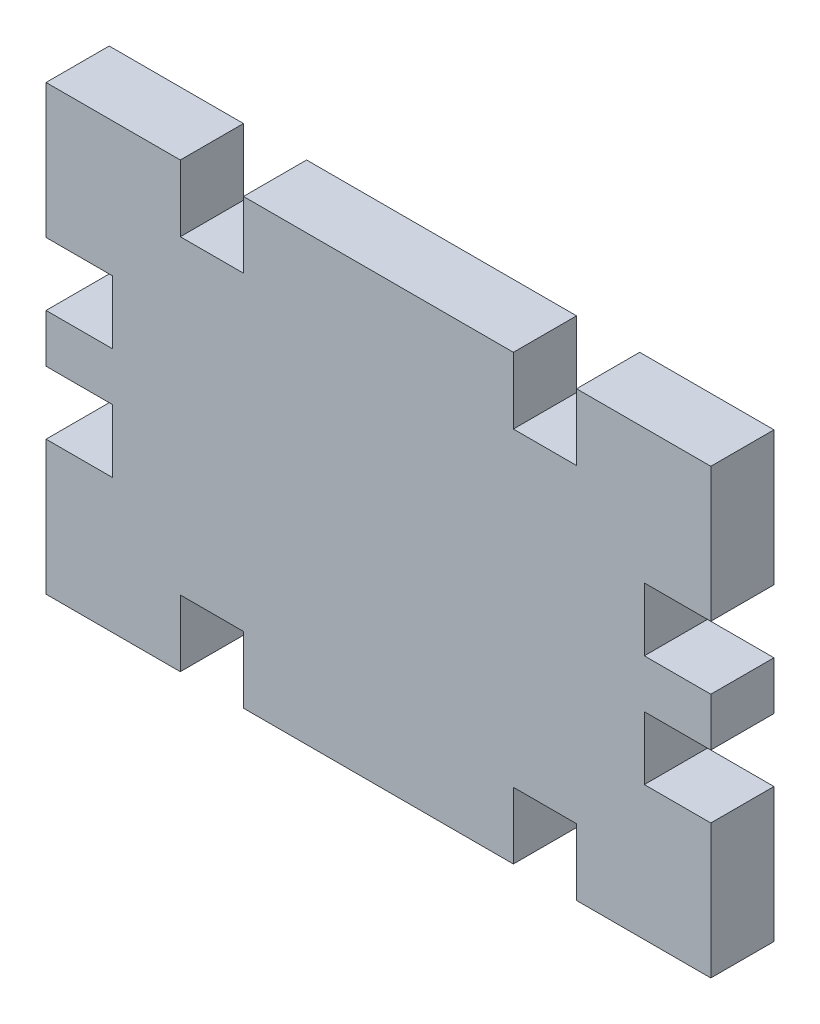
from build123d import *

# Parameters (mm, degrees)
SKETCH3_W           = 60
SKETCH3_H           = 40
BOSS_EXTRUDE1_DEPTH = 5.7
SKETCH9_W           = 6
SKETCH9_H           = 5.7
SKETCH9_W_2         = 5.7
SKETCH9_H_2         = 6
CUT_EXTRUDE9_DEPTH  = 10


with BuildPart() as part:
    # Sketch3 → Boss-Extrude1 (new body)
    with BuildSketch(Plane.XY):
        with Locations((51.697514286, -7.292422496)):
            Rectangle(SKETCH3_W, SKETCH3_H)
    extrude(amount=BOSS_EXTRUDE1_DEPTH)

    # Sketch9 → Cut-Extrude9 (cut)
    with BuildSketch(Plane.XY.offset(5.7)):
        with Locations((24.697514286, -12.324074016)):
            Rectangle(SKETCH9_W, SKETCH9_H)
        with Locations((36.665862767, -24.292422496)):
            Rectangle(SKETCH9_W_2, SKETCH9_H_2)
        with Locations((36.665862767, 9.707577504)):
            Rectangle(SKETCH9_W_2, SKETCH9_H_2)
        with Locations((24.697514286, -2.260770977)):
            Rectangle(SKETCH9_W, SKETCH9_H)
        with Locations((78.697514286, -2.260770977)):
            Rectangle(SKETCH9_W, SKETCH9_H)
        with Locations((66.729165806, 9.707577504)):
            Rectangle(SKETCH9_W_2, SKETCH9_H_2)
        with Locations((66.729165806, -24.292422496)):
            Rectangle(SKETCH9_W_2, SKETCH9_H_2)
        with Locations((78.697514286, -12.324074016)):
            Rectangle(SKETCH9_W, SKETCH9_H)
    extrude(amount=-CUT_EXTRUDE9_DEPTH, mode=Mode.SUBTRACT)


solid = part.part
